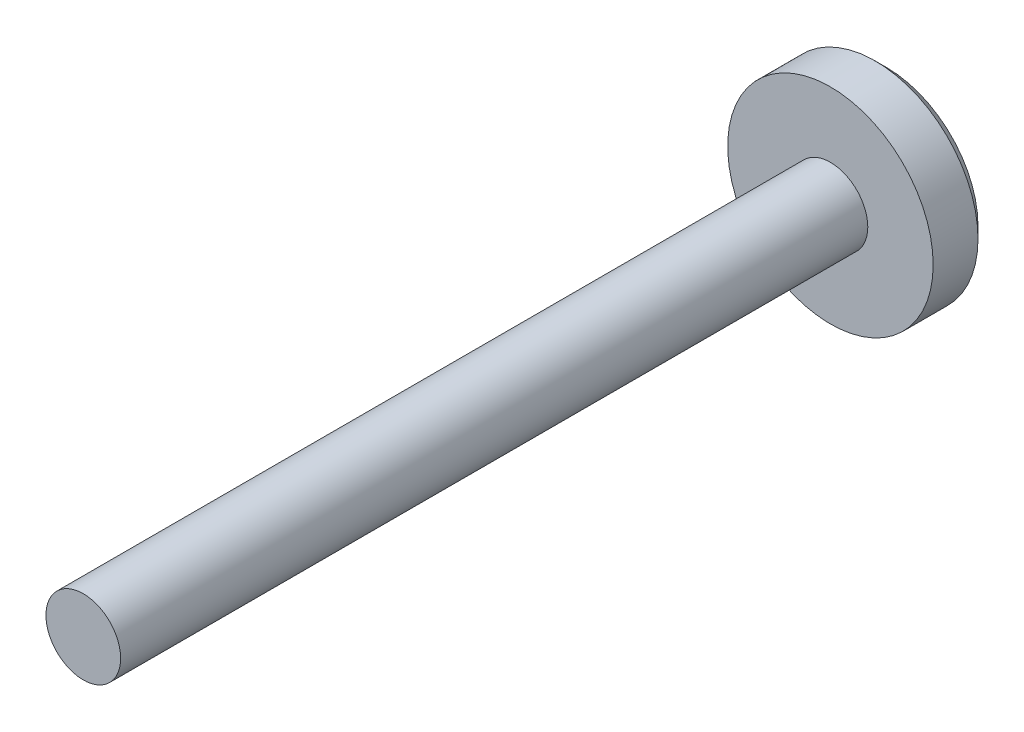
ISO-10303-21;
HEADER;
FILE_DESCRIPTION(('STEP AP214'),'2;1');
FILE_NAME('part.step','',(''),(''),'','','');
FILE_SCHEMA(('AUTOMOTIVE_DESIGN { 1 0 10303 214 1 1 1 1 }'));
ENDSEC;
DATA;
#1=APPLICATION_CONTEXT('core data for automotive mechanical design processes');
#2=APPLICATION_PROTOCOL_DEFINITION('international standard','automotive_design',2000,#1);
#3=PRODUCT_CONTEXT('',#1,'mechanical');
#4=PRODUCT('Part','Part','',(#3));
#5=PRODUCT_RELATED_PRODUCT_CATEGORY('part','',(#4));
#6=PRODUCT_DEFINITION_FORMATION('','',#4);
#7=PRODUCT_DEFINITION_CONTEXT('part definition',#1,'design');
#8=PRODUCT_DEFINITION('design','',#6,#7);
#9=PRODUCT_DEFINITION_SHAPE('','',#8);
#10=(LENGTH_UNIT() NAMED_UNIT(*) SI_UNIT(.MILLI.,.METRE.));
#11=(NAMED_UNIT(*) PLANE_ANGLE_UNIT() SI_UNIT($,.RADIAN.));
#12=(NAMED_UNIT(*) SI_UNIT($,.STERADIAN.) SOLID_ANGLE_UNIT());
#13=UNCERTAINTY_MEASURE_WITH_UNIT(LENGTH_MEASURE(1.E-05),#10,'distance_accuracy_value','');
#14=(GEOMETRIC_REPRESENTATION_CONTEXT(3) GLOBAL_UNCERTAINTY_ASSIGNED_CONTEXT((#13)) GLOBAL_UNIT_ASSIGNED_CONTEXT((#10,
#11,#12)) REPRESENTATION_CONTEXT('',''));
#15=CARTESIAN_POINT('',(0.,0.,0.));
#16=DIRECTION('',(0.,0.,1.));
#17=DIRECTION('',(1.,0.,0.));
#18=AXIS2_PLACEMENT_3D('',#15,#16,#17);
#19=CARTESIAN_POINT('',(0.,0.,15.));
#20=DIRECTION('',(0.,0.,1.));
#21=DIRECTION('',(1.,0.,0.));
#22=AXIS2_PLACEMENT_3D('',#19,#20,#21);
#23=PLANE('',#22);
#24=CARTESIAN_POINT('',(0.,0.,15.));
#25=DIRECTION('',(0.,0.,1.));
#26=DIRECTION('',(1.,0.,0.));
#27=AXIS2_PLACEMENT_3D('',#24,#25,#26);
#28=CIRCLE('',#27,27.5);
#29=CARTESIAN_POINT('',(27.5,0.,15.));
#30=VERTEX_POINT('',#29);
#31=EDGE_CURVE('E35',#30,#30,#28,.T.);
#32=ORIENTED_EDGE('',*,*,#31,.T.);
#33=EDGE_LOOP('',(#32));
#34=FACE_BOUND('',#33,.T.);
#35=CARTESIAN_POINT('',(0.,0.,15.));
#36=DIRECTION('',(0.,0.,1.));
#37=DIRECTION('',(1.,0.,0.));
#38=AXIS2_PLACEMENT_3D('',#35,#36,#37);
#39=CIRCLE('',#38,10.);
#40=CARTESIAN_POINT('',(10.,0.,15.));
#41=VERTEX_POINT('',#40);
#42=EDGE_CURVE('E44',#41,#41,#39,.T.);
#43=ORIENTED_EDGE('',*,*,#42,.F.);
#44=EDGE_LOOP('',(#43));
#45=FACE_BOUND('',#44,.T.);
#46=ADVANCED_FACE('F24',(#34,#45),#23,.T.);
#47=CARTESIAN_POINT('',(0.,0.,15.));
#48=DIRECTION('',(0.,0.,-1.));
#49=DIRECTION('',(-1.,0.,0.));
#50=AXIS2_PLACEMENT_3D('',#47,#48,#49);
#51=CYLINDRICAL_SURFACE('',#50,27.5);
#52=CARTESIAN_POINT('',(0.,0.,3.));
#53=DIRECTION('',(0.,0.,1.));
#54=DIRECTION('',(1.,0.,0.));
#55=AXIS2_PLACEMENT_3D('',#52,#53,#54);
#56=CIRCLE('',#55,27.5);
#57=CARTESIAN_POINT('',(27.5,0.,3.));
#58=VERTEX_POINT('',#57);
#59=EDGE_CURVE('E31',#58,#58,#56,.T.);
#60=ORIENTED_EDGE('',*,*,#59,.T.);
#61=EDGE_LOOP('',(#60));
#62=FACE_BOUND('',#61,.T.);
#63=ORIENTED_EDGE('',*,*,#31,.F.);
#64=EDGE_LOOP('',(#63));
#65=FACE_BOUND('',#64,.T.);
#66=ADVANCED_FACE('F26',(#62,#65),#51,.T.);
#67=CARTESIAN_POINT('',(0.,0.,0.));
#68=DIRECTION('',(0.,0.,1.));
#69=DIRECTION('',(1.,0.,0.));
#70=AXIS2_PLACEMENT_3D('',#67,#68,#69);
#71=PLANE('',#70);
#72=CARTESIAN_POINT('',(0.,0.,0.));
#73=DIRECTION('',(0.,0.,1.));
#74=DIRECTION('',(1.,0.,0.));
#75=AXIS2_PLACEMENT_3D('',#72,#73,#74);
#76=CIRCLE('',#75,24.5);
#77=CARTESIAN_POINT('',(24.5,0.,0.));
#78=VERTEX_POINT('',#77);
#79=EDGE_CURVE('E10',#78,#78,#76,.F.);
#80=ORIENTED_EDGE('',*,*,#79,.T.);
#81=EDGE_LOOP('',(#80));
#82=FACE_BOUND('',#81,.T.);
#83=ADVANCED_FACE('F55',(#82),#71,.F.);
#84=CARTESIAN_POINT('',(0.,0.,215.));
#85=DIRECTION('',(0.,0.,-1.));
#86=DIRECTION('',(-1.,0.,0.));
#87=AXIS2_PLACEMENT_3D('',#84,#85,#86);
#88=CYLINDRICAL_SURFACE('',#87,10.);
#89=CARTESIAN_POINT('',(0.,0.,215.));
#90=DIRECTION('',(0.,0.,1.));
#91=DIRECTION('',(1.,0.,0.));
#92=AXIS2_PLACEMENT_3D('',#89,#90,#91);
#93=CIRCLE('',#92,10.);
#94=CARTESIAN_POINT('',(10.,0.,215.));
#95=VERTEX_POINT('',#94);
#96=EDGE_CURVE('E39',#95,#95,#93,.T.);
#97=ORIENTED_EDGE('',*,*,#96,.F.);
#98=EDGE_LOOP('',(#97));
#99=FACE_BOUND('',#98,.T.);
#100=ORIENTED_EDGE('',*,*,#42,.T.);
#101=EDGE_LOOP('',(#100));
#102=FACE_BOUND('',#101,.T.);
#103=ADVANCED_FACE('F48',(#99,#102),#88,.T.);
#104=CARTESIAN_POINT('',(0.,0.,215.));
#105=DIRECTION('',(0.,0.,1.));
#106=DIRECTION('',(1.,0.,0.));
#107=AXIS2_PLACEMENT_3D('',#104,#105,#106);
#108=PLANE('',#107);
#109=ORIENTED_EDGE('',*,*,#96,.T.);
#110=EDGE_LOOP('',(#109));
#111=FACE_BOUND('',#110,.T.);
#112=ADVANCED_FACE('F61',(#111),#108,.T.);
#113=CARTESIAN_POINT('',(0.,0.,3.));
#114=DIRECTION('',(0.,0.,1.));
#115=DIRECTION('',(1.,0.,0.));
#116=AXIS2_PLACEMENT_3D('',#113,#114,#115);
#117=CONICAL_SURFACE('',#116,27.5,0.78539816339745);
#118=ORIENTED_EDGE('',*,*,#79,.F.);
#119=EDGE_LOOP('',(#118));
#120=FACE_BOUND('',#119,.T.);
#121=ORIENTED_EDGE('',*,*,#59,.F.);
#122=EDGE_LOOP('',(#121));
#123=FACE_BOUND('',#122,.T.);
#124=ADVANCED_FACE('F65',(#120,#123),#117,.T.);
#125=CLOSED_SHELL('',(#46,#66,#83,#103,#112,#124));
#126=MANIFOLD_SOLID_BREP('B2',#125);
#127=ADVANCED_BREP_SHAPE_REPRESENTATION('',(#18,#126),#14);
#128=SHAPE_DEFINITION_REPRESENTATION(#9,#127);
ENDSEC;
END-ISO-10303-21;
